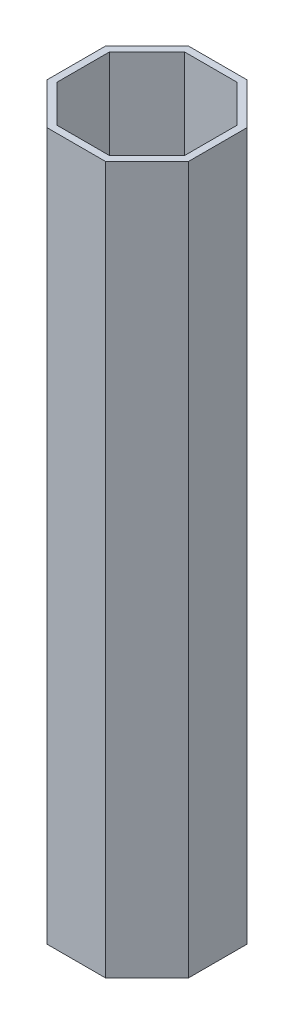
from build123d import *

# Parameters (mm, degrees)
FORME_EXT_RIEURE_DEPTH = 1000
TROU_T                 = -10


with BuildPart() as part:
    # Esquisse1 → Forme ext_rieure (new body)
    with BuildSketch(Plane(origin=(0, 0, 0), x_dir=(1, 0, 0), z_dir=(0, 1, 0))):
        Polygon((41.421356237, -100), (100, -41.421356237), (100, 41.421356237), (41.421356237, 100), (-41.421356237, 100), (-100, 41.421356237), (-100, -41.421356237), (-41.421356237, -100), align=None)
    extrude(amount=FORME_EXT_RIEURE_DEPTH)

    # Trou
    trou_openings = [part.faces().sort_by_distance(p)[0] for p in [
        (0, 1000, 0),
        (0, 0, 0),
    ]]
    offset(amount=TROU_T, openings=trou_openings, kind=Kind.INTERSECTION)


solid = part.part
